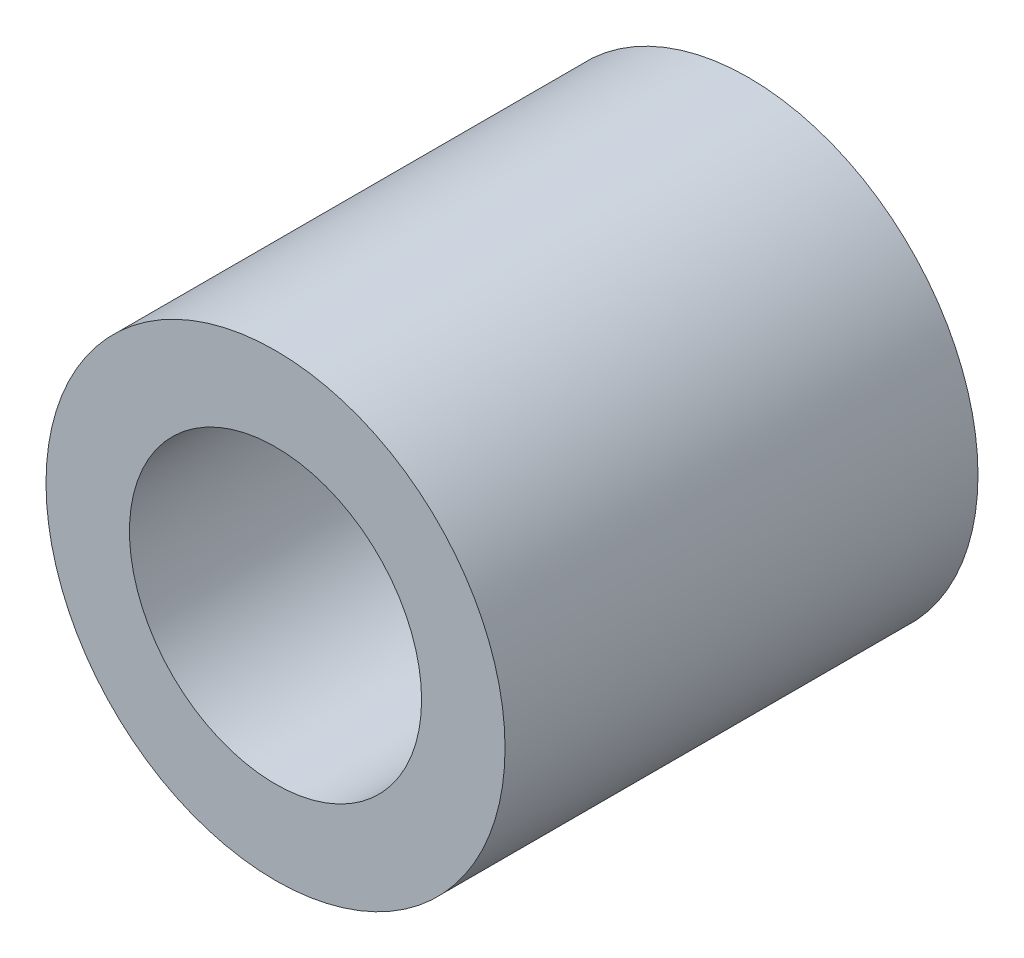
from build123d import *

# Parameters (mm, degrees)
ESQUISSE1_R      = 8.25
ESQUISSE1_R_2    = 5.25
EXTRUSION1_DEPTH = 17


with BuildPart() as part:
    # Esquisse1 → Extrusion1 (new body)
    with BuildSketch(Plane.XY):
        Circle(ESQUISSE1_R)
        Circle(ESQUISSE1_R_2, mode=Mode.SUBTRACT)
    extrude(amount=EXTRUSION1_DEPTH)


solid = part.part
